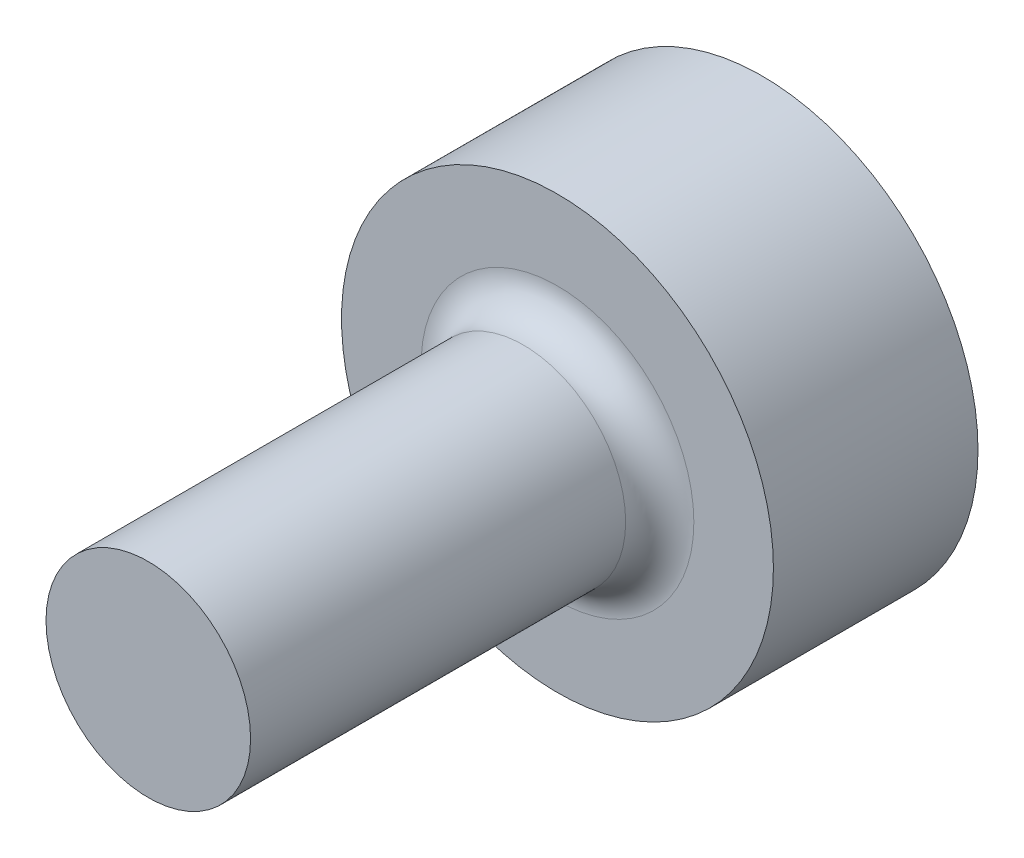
ISO-10303-21;
HEADER;
FILE_DESCRIPTION(('STEP AP214'),'2;1');
FILE_NAME('part.step','',(''),(''),'','','');
FILE_SCHEMA(('AUTOMOTIVE_DESIGN { 1 0 10303 214 1 1 1 1 }'));
ENDSEC;
DATA;
#1=APPLICATION_CONTEXT('core data for automotive mechanical design processes');
#2=APPLICATION_PROTOCOL_DEFINITION('international standard','automotive_design',2000,#1);
#3=PRODUCT_CONTEXT('',#1,'mechanical');
#4=PRODUCT('Part','Part','',(#3));
#5=PRODUCT_RELATED_PRODUCT_CATEGORY('part','',(#4));
#6=PRODUCT_DEFINITION_FORMATION('','',#4);
#7=PRODUCT_DEFINITION_CONTEXT('part definition',#1,'design');
#8=PRODUCT_DEFINITION('design','',#6,#7);
#9=PRODUCT_DEFINITION_SHAPE('','',#8);
#10=(LENGTH_UNIT() NAMED_UNIT(*) SI_UNIT(.MILLI.,.METRE.));
#11=(NAMED_UNIT(*) PLANE_ANGLE_UNIT() SI_UNIT($,.RADIAN.));
#12=(NAMED_UNIT(*) SI_UNIT($,.STERADIAN.) SOLID_ANGLE_UNIT());
#13=UNCERTAINTY_MEASURE_WITH_UNIT(LENGTH_MEASURE(1.E-05),#10,'distance_accuracy_value','');
#14=(GEOMETRIC_REPRESENTATION_CONTEXT(3) GLOBAL_UNCERTAINTY_ASSIGNED_CONTEXT((#13)) GLOBAL_UNIT_ASSIGNED_CONTEXT((#10,
#11,#12)) REPRESENTATION_CONTEXT('',''));
#15=CARTESIAN_POINT('',(0.,0.,0.));
#16=DIRECTION('',(0.,0.,1.));
#17=DIRECTION('',(1.,0.,0.));
#18=AXIS2_PLACEMENT_3D('',#15,#16,#17);
#19=CARTESIAN_POINT('',(0.,9.,36.));
#20=DIRECTION('',(0.,0.,-1.));
#21=DIRECTION('',(-1.,0.,0.));
#22=AXIS2_PLACEMENT_3D('',#19,#20,#21);
#23=PLANE('',#22);
#24=CARTESIAN_POINT('',(0.,0.,36.));
#25=DIRECTION('',(0.,0.,1.));
#26=DIRECTION('',(1.,0.,0.));
#27=AXIS2_PLACEMENT_3D('',#24,#25,#26);
#28=CIRCLE('',#27,9.);
#29=CARTESIAN_POINT('',(9.,0.,36.));
#30=VERTEX_POINT('',#29);
#31=EDGE_CURVE('E10',#30,#30,#28,.T.);
#32=ORIENTED_EDGE('',*,*,#31,.T.);
#33=EDGE_LOOP('',(#32));
#34=FACE_BOUND('',#33,.T.);
#35=ADVANCED_FACE('F32',(#34),#23,.F.);
#36=CARTESIAN_POINT('',(0.,0.,36.));
#37=DIRECTION('',(0.,0.,1.));
#38=DIRECTION('',(1.,0.,0.));
#39=AXIS2_PLACEMENT_3D('',#36,#37,#38);
#40=CYLINDRICAL_SURFACE('',#39,9.);
#41=ORIENTED_EDGE('',*,*,#31,.F.);
#42=EDGE_LOOP('',(#41));
#43=FACE_BOUND('',#42,.T.);
#44=CARTESIAN_POINT('',(0.,0.,3.));
#45=DIRECTION('',(0.,0.,1.));
#46=DIRECTION('',(1.,0.,0.));
#47=AXIS2_PLACEMENT_3D('',#44,#45,#46);
#48=CIRCLE('',#47,9.);
#49=CARTESIAN_POINT('',(9.,0.,3.));
#50=VERTEX_POINT('',#49);
#51=EDGE_CURVE('E38',#50,#50,#48,.T.);
#52=ORIENTED_EDGE('',*,*,#51,.T.);
#53=EDGE_LOOP('',(#52));
#54=FACE_BOUND('',#53,.T.);
#55=ADVANCED_FACE('F67',(#43,#54),#40,.T.);
#56=CARTESIAN_POINT('',(0.,0.,3.));
#57=DIRECTION('',(0.,0.,1.));
#58=DIRECTION('',(1.,0.,0.));
#59=AXIS2_PLACEMENT_3D('',#56,#57,#58);
#60=TOROIDAL_SURFACE('',#59,12.,3.);
#61=ORIENTED_EDGE('',*,*,#51,.F.);
#62=EDGE_LOOP('',(#61));
#63=FACE_BOUND('',#62,.T.);
#64=CARTESIAN_POINT('',(0.,0.,0.));
#65=DIRECTION('',(0.,0.,1.));
#66=DIRECTION('',(1.,0.,0.));
#67=AXIS2_PLACEMENT_3D('',#64,#65,#66);
#68=CIRCLE('',#67,12.);
#69=CARTESIAN_POINT('',(12.,0.,0.));
#70=VERTEX_POINT('',#69);
#71=EDGE_CURVE('E42',#70,#70,#68,.T.);
#72=ORIENTED_EDGE('',*,*,#71,.T.);
#73=EDGE_LOOP('',(#72));
#74=FACE_BOUND('',#73,.T.);
#75=ADVANCED_FACE('F71',(#63,#74),#60,.F.);
#76=CARTESIAN_POINT('',(0.,19.,0.));
#77=DIRECTION('',(0.,0.,-1.));
#78=DIRECTION('',(-1.,0.,0.));
#79=AXIS2_PLACEMENT_3D('',#76,#77,#78);
#80=PLANE('',#79);
#81=ORIENTED_EDGE('',*,*,#71,.F.);
#82=EDGE_LOOP('',(#81));
#83=FACE_BOUND('',#82,.T.);
#84=CARTESIAN_POINT('',(0.,0.,0.));
#85=DIRECTION('',(0.,0.,1.));
#86=DIRECTION('',(1.,0.,0.));
#87=AXIS2_PLACEMENT_3D('',#84,#85,#86);
#88=CIRCLE('',#87,19.);
#89=CARTESIAN_POINT('',(19.,0.,0.));
#90=VERTEX_POINT('',#89);
#91=EDGE_CURVE('E46',#90,#90,#88,.T.);
#92=ORIENTED_EDGE('',*,*,#91,.T.);
#93=EDGE_LOOP('',(#92));
#94=FACE_BOUND('',#93,.T.);
#95=ADVANCED_FACE('F63',(#83,#94),#80,.F.);
#96=CARTESIAN_POINT('',(0.,0.,36.));
#97=DIRECTION('',(0.,0.,1.));
#98=DIRECTION('',(1.,0.,0.));
#99=AXIS2_PLACEMENT_3D('',#96,#97,#98);
#100=CYLINDRICAL_SURFACE('',#99,19.);
#101=ORIENTED_EDGE('',*,*,#91,.F.);
#102=EDGE_LOOP('',(#101));
#103=FACE_BOUND('',#102,.T.);
#104=CARTESIAN_POINT('',(0.,0.,-18.));
#105=DIRECTION('',(0.,0.,1.));
#106=DIRECTION('',(1.,0.,0.));
#107=AXIS2_PLACEMENT_3D('',#104,#105,#106);
#108=CIRCLE('',#107,19.);
#109=CARTESIAN_POINT('',(19.,0.,-18.));
#110=VERTEX_POINT('',#109);
#111=EDGE_CURVE('E51',#110,#110,#108,.T.);
#112=ORIENTED_EDGE('',*,*,#111,.T.);
#113=EDGE_LOOP('',(#112));
#114=FACE_BOUND('',#113,.T.);
#115=ADVANCED_FACE('F55',(#103,#114),#100,.T.);
#116=CARTESIAN_POINT('',(0.,0.,-18.));
#117=DIRECTION('',(0.,0.,1.));
#118=DIRECTION('',(1.,0.,0.));
#119=AXIS2_PLACEMENT_3D('',#116,#117,#118);
#120=PLANE('',#119);
#121=ORIENTED_EDGE('',*,*,#111,.F.);
#122=EDGE_LOOP('',(#121));
#123=FACE_BOUND('',#122,.T.);
#124=ADVANCED_FACE('F57',(#123),#120,.F.);
#125=CLOSED_SHELL('',(#35,#55,#75,#95,#115,#124));
#126=MANIFOLD_SOLID_BREP('B2',#125);
#127=ADVANCED_BREP_SHAPE_REPRESENTATION('',(#18,#126),#14);
#128=SHAPE_DEFINITION_REPRESENTATION(#9,#127);
ENDSEC;
END-ISO-10303-21;
